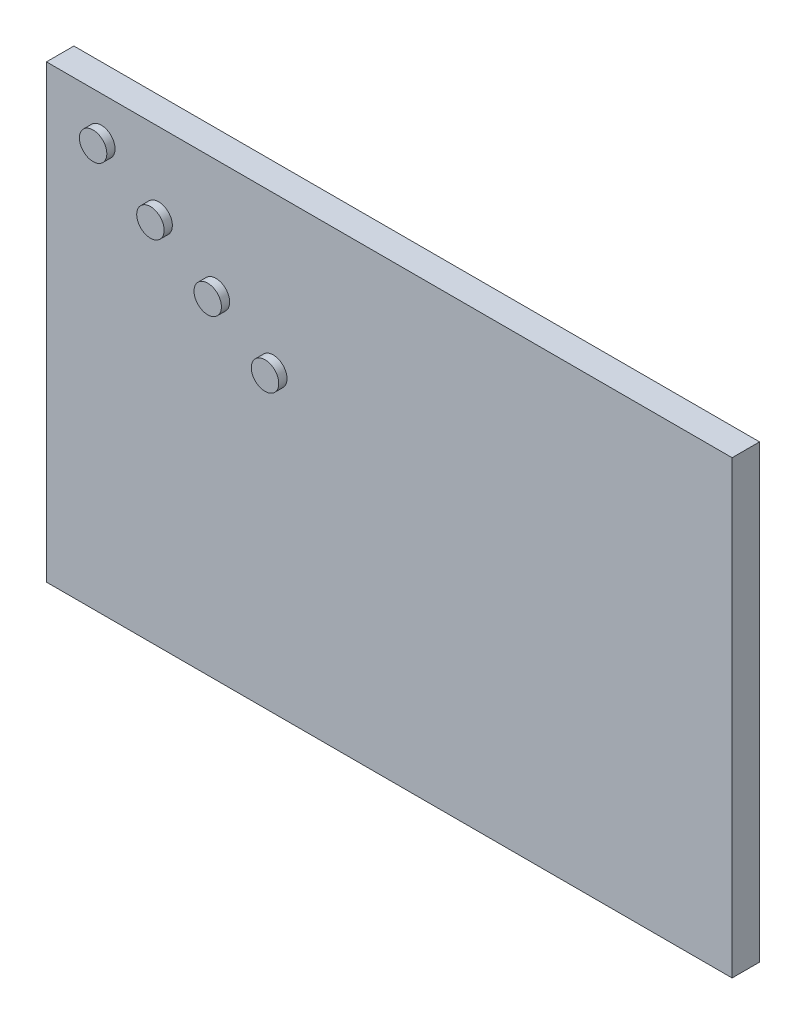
ISO-10303-21;
HEADER;
FILE_DESCRIPTION(('STEP AP214'),'2;1');
FILE_NAME('part.step','',(''),(''),'','','');
FILE_SCHEMA(('AUTOMOTIVE_DESIGN { 1 0 10303 214 1 1 1 1 }'));
ENDSEC;
DATA;
#1=APPLICATION_CONTEXT('core data for automotive mechanical design processes');
#2=APPLICATION_PROTOCOL_DEFINITION('international standard','automotive_design',2000,#1);
#3=PRODUCT_CONTEXT('',#1,'mechanical');
#4=PRODUCT('Part','Part','',(#3));
#5=PRODUCT_RELATED_PRODUCT_CATEGORY('part','',(#4));
#6=PRODUCT_DEFINITION_FORMATION('','',#4);
#7=PRODUCT_DEFINITION_CONTEXT('part definition',#1,'design');
#8=PRODUCT_DEFINITION('design','',#6,#7);
#9=PRODUCT_DEFINITION_SHAPE('','',#8);
#10=(LENGTH_UNIT() NAMED_UNIT(*) SI_UNIT(.MILLI.,.METRE.));
#11=(NAMED_UNIT(*) PLANE_ANGLE_UNIT() SI_UNIT($,.RADIAN.));
#12=(NAMED_UNIT(*) SI_UNIT($,.STERADIAN.) SOLID_ANGLE_UNIT());
#13=UNCERTAINTY_MEASURE_WITH_UNIT(LENGTH_MEASURE(1.E-05),#10,'distance_accuracy_value','');
#14=(GEOMETRIC_REPRESENTATION_CONTEXT(3) GLOBAL_UNCERTAINTY_ASSIGNED_CONTEXT((#13)) GLOBAL_UNIT_ASSIGNED_CONTEXT((#10,
#11,#12)) REPRESENTATION_CONTEXT('',''));
#15=CARTESIAN_POINT('',(0.,0.,0.));
#16=DIRECTION('',(0.,0.,1.));
#17=DIRECTION('',(1.,0.,0.));
#18=AXIS2_PLACEMENT_3D('',#15,#16,#17);
#19=CARTESIAN_POINT('',(200.,1492.49625674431,30.));
#20=DIRECTION('',(0.,0.,-1.));
#21=DIRECTION('',(-1.,0.,0.));
#22=AXIS2_PLACEMENT_3D('',#19,#20,#21);
#23=CYLINDRICAL_SURFACE('',#22,50.);
#24=CARTESIAN_POINT('',(200.,1492.49625674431,30.));
#25=DIRECTION('',(0.,0.,1.));
#26=DIRECTION('',(1.,0.,0.));
#27=AXIS2_PLACEMENT_3D('',#24,#25,#26);
#28=CIRCLE('',#27,50.);
#29=CARTESIAN_POINT('',(250.,1492.49625674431,30.));
#30=VERTEX_POINT('',#29);
#31=EDGE_CURVE('E11',#30,#30,#28,.T.);
#32=ORIENTED_EDGE('',*,*,#31,.F.);
#33=EDGE_LOOP('',(#32));
#34=FACE_BOUND('',#33,.T.);
#35=CARTESIAN_POINT('',(200.,1492.49625674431,0.));
#36=DIRECTION('',(0.,0.,1.));
#37=DIRECTION('',(1.,0.,0.));
#38=AXIS2_PLACEMENT_3D('',#35,#36,#37);
#39=CIRCLE('',#38,50.);
#40=CARTESIAN_POINT('',(250.,1492.49625674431,0.));
#41=VERTEX_POINT('',#40);
#42=EDGE_CURVE('E44',#41,#41,#39,.T.);
#43=ORIENTED_EDGE('',*,*,#42,.T.);
#44=EDGE_LOOP('',(#43));
#45=FACE_BOUND('',#44,.T.);
#46=ADVANCED_FACE('F41',(#34,#45),#23,.T.);
#47=CARTESIAN_POINT('',(200.,1492.49625674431,30.));
#48=DIRECTION('',(0.,0.,1.));
#49=DIRECTION('',(1.,0.,0.));
#50=AXIS2_PLACEMENT_3D('',#47,#48,#49);
#51=PLANE('',#50);
#52=ORIENTED_EDGE('',*,*,#31,.T.);
#53=EDGE_LOOP('',(#52));
#54=FACE_BOUND('',#53,.T.);
#55=ADVANCED_FACE('F56',(#54),#51,.T.);
#56=CARTESIAN_POINT('',(200.,1492.49625674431,0.));
#57=DIRECTION('',(0.,0.,1.));
#58=DIRECTION('',(1.,0.,0.));
#59=AXIS2_PLACEMENT_3D('',#56,#57,#58);
#60=PLANE('',#59);
#61=ORIENTED_EDGE('',*,*,#42,.F.);
#62=EDGE_LOOP('',(#61));
#63=FACE_BOUND('',#62,.T.);
#64=ADVANCED_FACE('F54',(#63),#60,.F.);
#65=CLOSED_SHELL('',(#46,#55,#64));
#66=MANIFOLD_SOLID_BREP('B2',#65);
#67=CARTESIAN_POINT('',(0.,1642.49625674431,0.));
#68=DIRECTION('',(0.,0.,-1.));
#69=DIRECTION('',(-1.,0.,0.));
#70=AXIS2_PLACEMENT_3D('',#67,#68,#69);
#71=PLANE('',#70);
#72=CARTESIAN_POINT('',(617.845958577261,1217.89699436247,0.));
#73=DIRECTION('',(0.,0.,-1.));
#74=DIRECTION('',(-1.,0.,0.));
#75=AXIS2_PLACEMENT_3D('',#72,#73,#74);
#76=CIRCLE('',#75,50.);
#77=CARTESIAN_POINT('',(567.845958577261,1217.89699436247,0.));
#78=VERTEX_POINT('',#77);
#79=EDGE_CURVE('E91',#78,#78,#76,.F.);
#80=ORIENTED_EDGE('',*,*,#79,.F.);
#81=EDGE_LOOP('',(#80));
#82=FACE_BOUND('',#81,.T.);
#83=DIRECTION('',(0.,-1.,0.));
#84=VECTOR('',#83,1.);
#85=CARTESIAN_POINT('',(0.,0.,0.));
#86=LINE('',#85,#84);
#87=CARTESIAN_POINT('',(0.,1642.49625674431,0.));
#88=VERTEX_POINT('',#87);
#89=CARTESIAN_POINT('',(0.,0.,0.));
#90=VERTEX_POINT('',#89);
#91=EDGE_CURVE('E151',#88,#90,#86,.T.);
#92=ORIENTED_EDGE('',*,*,#91,.T.);
#93=DIRECTION('',(1.,0.,0.));
#94=VECTOR('',#93,1.);
#95=CARTESIAN_POINT('',(0.,0.,0.));
#96=LINE('',#95,#94);
#97=CARTESIAN_POINT('',(2499.31633794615,0.,0.));
#98=VERTEX_POINT('',#97);
#99=EDGE_CURVE('E154',#90,#98,#96,.T.);
#100=ORIENTED_EDGE('',*,*,#99,.T.);
#101=DIRECTION('',(0.,1.,0.));
#102=VECTOR('',#101,1.);
#103=CARTESIAN_POINT('',(2499.31633794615,0.,0.));
#104=LINE('',#103,#102);
#105=CARTESIAN_POINT('',(2499.31633794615,1642.49625674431,0.));
#106=VERTEX_POINT('',#105);
#107=EDGE_CURVE('E135',#98,#106,#104,.T.);
#108=ORIENTED_EDGE('',*,*,#107,.T.);
#109=DIRECTION('',(-1.,0.,0.));
#110=VECTOR('',#109,1.);
#111=CARTESIAN_POINT('',(0.,1642.49625674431,0.));
#112=LINE('',#111,#110);
#113=EDGE_CURVE('E146',#106,#88,#112,.T.);
#114=ORIENTED_EDGE('',*,*,#113,.T.);
#115=EDGE_LOOP('',(#92,#100,#108,#114));
#116=FACE_BOUND('',#115,.T.);
#117=CARTESIAN_POINT('',(408.922979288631,1355.19662555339,0.));
#118=DIRECTION('',(0.,0.,-1.));
#119=DIRECTION('',(-1.,0.,0.));
#120=AXIS2_PLACEMENT_3D('',#117,#118,#119);
#121=CIRCLE('',#120,50.);
#122=CARTESIAN_POINT('',(358.922979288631,1355.19662555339,0.));
#123=VERTEX_POINT('',#122);
#124=EDGE_CURVE('E161',#123,#123,#121,.F.);
#125=ORIENTED_EDGE('',*,*,#124,.F.);
#126=EDGE_LOOP('',(#125));
#127=FACE_BOUND('',#126,.T.);
#128=CARTESIAN_POINT('',(826.768937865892,1080.59736317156,0.));
#129=DIRECTION('',(0.,0.,-1.));
#130=DIRECTION('',(-1.,0.,0.));
#131=AXIS2_PLACEMENT_3D('',#128,#129,#130);
#132=CIRCLE('',#131,50.);
#133=CARTESIAN_POINT('',(776.768937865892,1080.59736317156,0.));
#134=VERTEX_POINT('',#133);
#135=EDGE_CURVE('E39',#134,#134,#132,.F.);
#136=ORIENTED_EDGE('',*,*,#135,.F.);
#137=EDGE_LOOP('',(#136));
#138=FACE_BOUND('',#137,.T.);
#139=ADVANCED_FACE('F82',(#82,#116,#127,#138),#71,.F.);
#140=CARTESIAN_POINT('',(0.,0.,-100.));
#141=DIRECTION('',(-1.,0.,0.));
#142=DIRECTION('',(0.,0.,1.));
#143=AXIS2_PLACEMENT_3D('',#140,#141,#142);
#144=PLANE('',#143);
#145=ORIENTED_EDGE('',*,*,#91,.F.);
#146=DIRECTION('',(0.,0.,1.));
#147=VECTOR('',#146,1.);
#148=CARTESIAN_POINT('',(0.,1642.49625674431,-100.));
#149=LINE('',#148,#147);
#150=CARTESIAN_POINT('',(0.,1642.49625674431,-100.));
#151=VERTEX_POINT('',#150);
#152=EDGE_CURVE('E99',#151,#88,#149,.T.);
#153=ORIENTED_EDGE('',*,*,#152,.F.);
#154=DIRECTION('',(0.,-1.,0.));
#155=VECTOR('',#154,1.);
#156=CARTESIAN_POINT('',(0.,0.,-100.));
#157=LINE('',#156,#155);
#158=CARTESIAN_POINT('',(0.,0.,-100.));
#159=VERTEX_POINT('',#158);
#160=EDGE_CURVE('E144',#151,#159,#157,.T.);
#161=ORIENTED_EDGE('',*,*,#160,.T.);
#162=DIRECTION('',(0.,0.,1.));
#163=VECTOR('',#162,1.);
#164=CARTESIAN_POINT('',(0.,0.,-100.));
#165=LINE('',#164,#163);
#166=EDGE_CURVE('E127',#159,#90,#165,.T.);
#167=ORIENTED_EDGE('',*,*,#166,.T.);
#168=EDGE_LOOP('',(#145,#153,#161,#167));
#169=FACE_BOUND('',#168,.T.);
#170=ADVANCED_FACE('F84',(#169),#144,.T.);
#171=CARTESIAN_POINT('',(0.,1642.49625674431,-100.));
#172=DIRECTION('',(0.,1.,0.));
#173=DIRECTION('',(0.,0.,1.));
#174=AXIS2_PLACEMENT_3D('',#171,#172,#173);
#175=PLANE('',#174);
#176=ORIENTED_EDGE('',*,*,#113,.F.);
#177=DIRECTION('',(0.,0.,1.));
#178=VECTOR('',#177,1.);
#179=CARTESIAN_POINT('',(2499.31633794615,1642.49625674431,-100.));
#180=LINE('',#179,#178);
#181=CARTESIAN_POINT('',(2499.31633794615,1642.49625674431,-100.));
#182=VERTEX_POINT('',#181);
#183=EDGE_CURVE('E116',#182,#106,#180,.T.);
#184=ORIENTED_EDGE('',*,*,#183,.F.);
#185=DIRECTION('',(-1.,0.,0.));
#186=VECTOR('',#185,1.);
#187=CARTESIAN_POINT('',(0.,1642.49625674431,-100.));
#188=LINE('',#187,#186);
#189=EDGE_CURVE('E141',#182,#151,#188,.T.);
#190=ORIENTED_EDGE('',*,*,#189,.T.);
#191=ORIENTED_EDGE('',*,*,#152,.T.);
#192=EDGE_LOOP('',(#176,#184,#190,#191));
#193=FACE_BOUND('',#192,.T.);
#194=ADVANCED_FACE('F207',(#193),#175,.T.);
#195=CARTESIAN_POINT('',(2499.31633794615,0.,-100.));
#196=DIRECTION('',(1.,0.,0.));
#197=DIRECTION('',(0.,0.,-1.));
#198=AXIS2_PLACEMENT_3D('',#195,#196,#197);
#199=PLANE('',#198);
#200=ORIENTED_EDGE('',*,*,#107,.F.);
#201=DIRECTION('',(0.,0.,1.));
#202=VECTOR('',#201,1.);
#203=CARTESIAN_POINT('',(2499.31633794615,0.,-100.));
#204=LINE('',#203,#202);
#205=CARTESIAN_POINT('',(2499.31633794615,0.,-100.));
#206=VERTEX_POINT('',#205);
#207=EDGE_CURVE('E130',#206,#98,#204,.T.);
#208=ORIENTED_EDGE('',*,*,#207,.F.);
#209=DIRECTION('',(0.,1.,0.));
#210=VECTOR('',#209,1.);
#211=CARTESIAN_POINT('',(2499.31633794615,0.,-100.));
#212=LINE('',#211,#210);
#213=EDGE_CURVE('E133',#206,#182,#212,.T.);
#214=ORIENTED_EDGE('',*,*,#213,.T.);
#215=ORIENTED_EDGE('',*,*,#183,.T.);
#216=EDGE_LOOP('',(#200,#208,#214,#215));
#217=FACE_BOUND('',#216,.T.);
#218=ADVANCED_FACE('F132',(#217),#199,.T.);
#219=CARTESIAN_POINT('',(0.,0.,-100.));
#220=DIRECTION('',(0.,-1.,0.));
#221=DIRECTION('',(0.,0.,-1.));
#222=AXIS2_PLACEMENT_3D('',#219,#220,#221);
#223=PLANE('',#222);
#224=ORIENTED_EDGE('',*,*,#99,.F.);
#225=ORIENTED_EDGE('',*,*,#166,.F.);
#226=DIRECTION('',(1.,0.,0.));
#227=VECTOR('',#226,1.);
#228=CARTESIAN_POINT('',(0.,0.,-100.));
#229=LINE('',#228,#227);
#230=EDGE_CURVE('E140',#159,#206,#229,.T.);
#231=ORIENTED_EDGE('',*,*,#230,.T.);
#232=ORIENTED_EDGE('',*,*,#207,.T.);
#233=EDGE_LOOP('',(#224,#225,#231,#232));
#234=FACE_BOUND('',#233,.T.);
#235=ADVANCED_FACE('F143',(#234),#223,.T.);
#236=CARTESIAN_POINT('',(0.,1642.49625674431,-100.));
#237=DIRECTION('',(0.,0.,-1.));
#238=DIRECTION('',(-1.,0.,0.));
#239=AXIS2_PLACEMENT_3D('',#236,#237,#238);
#240=PLANE('',#239);
#241=ORIENTED_EDGE('',*,*,#160,.F.);
#242=ORIENTED_EDGE('',*,*,#189,.F.);
#243=ORIENTED_EDGE('',*,*,#213,.F.);
#244=ORIENTED_EDGE('',*,*,#230,.F.);
#245=EDGE_LOOP('',(#241,#242,#243,#244));
#246=FACE_BOUND('',#245,.T.);
#247=ADVANCED_FACE('F139',(#246),#240,.T.);
#248=CARTESIAN_POINT('',(408.922979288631,1355.19662555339,30.));
#249=DIRECTION('',(0.,0.,-1.));
#250=DIRECTION('',(-1.,0.,0.));
#251=AXIS2_PLACEMENT_3D('',#248,#249,#250);
#252=CYLINDRICAL_SURFACE('',#251,50.);
#253=CARTESIAN_POINT('',(408.922979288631,1355.19662555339,30.));
#254=DIRECTION('',(0.,0.,1.));
#255=DIRECTION('',(1.,0.,0.));
#256=AXIS2_PLACEMENT_3D('',#253,#254,#255);
#257=CIRCLE('',#256,50.);
#258=CARTESIAN_POINT('',(458.922979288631,1355.19662555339,30.));
#259=VERTEX_POINT('',#258);
#260=EDGE_CURVE('E155',#259,#259,#257,.T.);
#261=ORIENTED_EDGE('',*,*,#260,.F.);
#262=EDGE_LOOP('',(#261));
#263=FACE_BOUND('',#262,.T.);
#264=ORIENTED_EDGE('',*,*,#124,.T.);
#265=EDGE_LOOP('',(#264));
#266=FACE_BOUND('',#265,.T.);
#267=ADVANCED_FACE('F192',(#263,#266),#252,.T.);
#268=CARTESIAN_POINT('',(408.922979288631,1355.19662555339,30.));
#269=DIRECTION('',(0.,0.,1.));
#270=DIRECTION('',(1.,0.,0.));
#271=AXIS2_PLACEMENT_3D('',#268,#269,#270);
#272=PLANE('',#271);
#273=ORIENTED_EDGE('',*,*,#260,.T.);
#274=EDGE_LOOP('',(#273));
#275=FACE_BOUND('',#274,.T.);
#276=ADVANCED_FACE('F196',(#275),#272,.T.);
#277=CARTESIAN_POINT('',(617.845958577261,1217.89699436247,30.));
#278=DIRECTION('',(0.,0.,-1.));
#279=DIRECTION('',(-1.,0.,0.));
#280=AXIS2_PLACEMENT_3D('',#277,#278,#279);
#281=CYLINDRICAL_SURFACE('',#280,50.);
#282=CARTESIAN_POINT('',(617.845958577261,1217.89699436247,30.));
#283=DIRECTION('',(0.,0.,1.));
#284=DIRECTION('',(1.,0.,0.));
#285=AXIS2_PLACEMENT_3D('',#282,#283,#284);
#286=CIRCLE('',#285,50.);
#287=CARTESIAN_POINT('',(667.845958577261,1217.89699436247,30.));
#288=VERTEX_POINT('',#287);
#289=EDGE_CURVE('E285',#288,#288,#286,.T.);
#290=ORIENTED_EDGE('',*,*,#289,.F.);
#291=EDGE_LOOP('',(#290));
#292=FACE_BOUND('',#291,.T.);
#293=ORIENTED_EDGE('',*,*,#79,.T.);
#294=EDGE_LOOP('',(#293));
#295=FACE_BOUND('',#294,.T.);
#296=ADVANCED_FACE('F168',(#292,#295),#281,.T.);
#297=CARTESIAN_POINT('',(617.845958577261,1217.89699436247,30.));
#298=DIRECTION('',(0.,0.,1.));
#299=DIRECTION('',(1.,0.,0.));
#300=AXIS2_PLACEMENT_3D('',#297,#298,#299);
#301=PLANE('',#300);
#302=ORIENTED_EDGE('',*,*,#289,.T.);
#303=EDGE_LOOP('',(#302));
#304=FACE_BOUND('',#303,.T.);
#305=ADVANCED_FACE('F181',(#304),#301,.T.);
#306=CARTESIAN_POINT('',(826.768937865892,1080.59736317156,30.));
#307=DIRECTION('',(0.,0.,-1.));
#308=DIRECTION('',(-1.,0.,0.));
#309=AXIS2_PLACEMENT_3D('',#306,#307,#308);
#310=CYLINDRICAL_SURFACE('',#309,50.);
#311=CARTESIAN_POINT('',(826.768937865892,1080.59736317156,30.));
#312=DIRECTION('',(0.,0.,1.));
#313=DIRECTION('',(1.,0.,0.));
#314=AXIS2_PLACEMENT_3D('',#311,#312,#313);
#315=CIRCLE('',#314,50.);
#316=CARTESIAN_POINT('',(876.768937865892,1080.59736317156,30.));
#317=VERTEX_POINT('',#316);
#318=EDGE_CURVE('E287',#317,#317,#315,.T.);
#319=ORIENTED_EDGE('',*,*,#318,.F.);
#320=EDGE_LOOP('',(#319));
#321=FACE_BOUND('',#320,.T.);
#322=ORIENTED_EDGE('',*,*,#135,.T.);
#323=EDGE_LOOP('',(#322));
#324=FACE_BOUND('',#323,.T.);
#325=ADVANCED_FACE('F178',(#321,#324),#310,.T.);
#326=CARTESIAN_POINT('',(826.768937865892,1080.59736317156,30.));
#327=DIRECTION('',(0.,0.,1.));
#328=DIRECTION('',(1.,0.,0.));
#329=AXIS2_PLACEMENT_3D('',#326,#327,#328);
#330=PLANE('',#329);
#331=ORIENTED_EDGE('',*,*,#318,.T.);
#332=EDGE_LOOP('',(#331));
#333=FACE_BOUND('',#332,.T.);
#334=ADVANCED_FACE('F180',(#333),#330,.T.);
#335=CLOSED_SHELL('',(#139,#170,#194,#218,#235,#247,#267,#276,#296,#305,#325,#334));
#336=MANIFOLD_SOLID_BREP('B6',#335);
#337=ADVANCED_BREP_SHAPE_REPRESENTATION('',(#18,#66,#336),#14);
#338=SHAPE_DEFINITION_REPRESENTATION(#9,#337);
ENDSEC;
END-ISO-10303-21;
